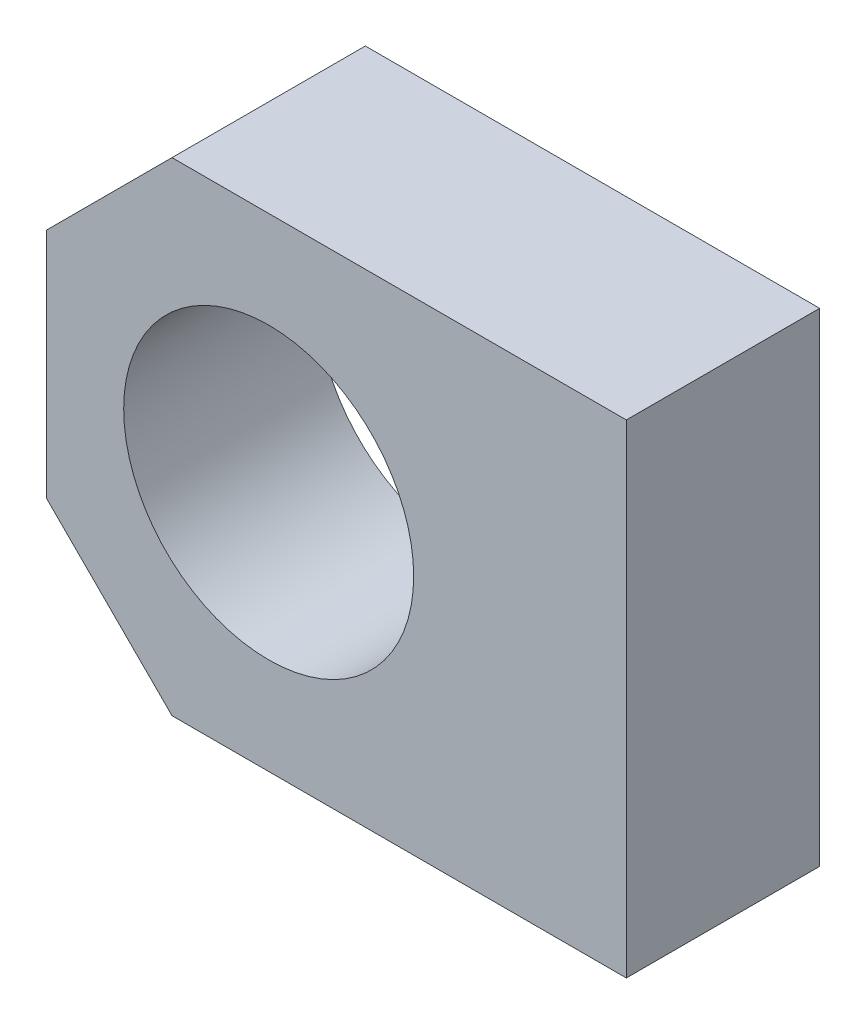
ISO-10303-21;
HEADER;
FILE_DESCRIPTION(('STEP AP214'),'2;1');
FILE_NAME('part.step','',(''),(''),'','','');
FILE_SCHEMA(('AUTOMOTIVE_DESIGN { 1 0 10303 214 1 1 1 1 }'));
ENDSEC;
DATA;
#1=APPLICATION_CONTEXT('core data for automotive mechanical design processes');
#2=APPLICATION_PROTOCOL_DEFINITION('international standard','automotive_design',2000,#1);
#3=PRODUCT_CONTEXT('',#1,'mechanical');
#4=PRODUCT('Part','Part','',(#3));
#5=PRODUCT_RELATED_PRODUCT_CATEGORY('part','',(#4));
#6=PRODUCT_DEFINITION_FORMATION('','',#4);
#7=PRODUCT_DEFINITION_CONTEXT('part definition',#1,'design');
#8=PRODUCT_DEFINITION('design','',#6,#7);
#9=PRODUCT_DEFINITION_SHAPE('','',#8);
#10=(LENGTH_UNIT() NAMED_UNIT(*) SI_UNIT(.MILLI.,.METRE.));
#11=(NAMED_UNIT(*) PLANE_ANGLE_UNIT() SI_UNIT($,.RADIAN.));
#12=(NAMED_UNIT(*) SI_UNIT($,.STERADIAN.) SOLID_ANGLE_UNIT());
#13=UNCERTAINTY_MEASURE_WITH_UNIT(LENGTH_MEASURE(1.E-05),#10,'distance_accuracy_value','');
#14=(GEOMETRIC_REPRESENTATION_CONTEXT(3) GLOBAL_UNCERTAINTY_ASSIGNED_CONTEXT((#13)) GLOBAL_UNIT_ASSIGNED_CONTEXT((#10,
#11,#12)) REPRESENTATION_CONTEXT('',''));
#15=CARTESIAN_POINT('',(0.,0.,0.));
#16=DIRECTION('',(0.,0.,1.));
#17=DIRECTION('',(1.,0.,0.));
#18=AXIS2_PLACEMENT_3D('',#15,#16,#17);
#19=CARTESIAN_POINT('',(0.,0.,20.));
#20=DIRECTION('',(0.,0.,1.));
#21=DIRECTION('',(1.,0.,0.));
#22=AXIS2_PLACEMENT_3D('',#19,#20,#21);
#23=PLANE('',#22);
#24=DIRECTION('',(0.,-1.,0.));
#25=VECTOR('',#24,1.);
#26=CARTESIAN_POINT('',(-60.,0.,20.));
#27=LINE('',#26,#25);
#28=CARTESIAN_POINT('',(-60.,37.,20.));
#29=VERTEX_POINT('',#28);
#30=CARTESIAN_POINT('',(-60.,13.,20.));
#31=VERTEX_POINT('',#30);
#32=EDGE_CURVE('E93',#29,#31,#27,.T.);
#33=ORIENTED_EDGE('',*,*,#32,.T.);
#34=DIRECTION('',(-0.707106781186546,0.707106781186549,0.));
#35=VECTOR('',#34,1.);
#36=CARTESIAN_POINT('',(-23.5000000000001,-23.5,20.));
#37=LINE('',#36,#35);
#38=CARTESIAN_POINT('',(-47.,0.,20.));
#39=VERTEX_POINT('',#38);
#40=EDGE_CURVE('E41',#31,#39,#37,.F.);
#41=ORIENTED_EDGE('',*,*,#40,.T.);
#42=DIRECTION('',(1.,0.,0.));
#43=VECTOR('',#42,1.);
#44=CARTESIAN_POINT('',(0.,0.,20.));
#45=LINE('',#44,#43);
#46=CARTESIAN_POINT('',(0.,0.,20.));
#47=VERTEX_POINT('',#46);
#48=EDGE_CURVE('E99',#39,#47,#45,.T.);
#49=ORIENTED_EDGE('',*,*,#48,.T.);
#50=DIRECTION('',(0.,1.,0.));
#51=VECTOR('',#50,1.);
#52=CARTESIAN_POINT('',(0.,0.,20.));
#53=LINE('',#52,#51);
#54=CARTESIAN_POINT('',(0.,50.,20.));
#55=VERTEX_POINT('',#54);
#56=EDGE_CURVE('E94',#47,#55,#53,.T.);
#57=ORIENTED_EDGE('',*,*,#56,.T.);
#58=DIRECTION('',(-1.,0.,0.));
#59=VECTOR('',#58,1.);
#60=CARTESIAN_POINT('',(0.,50.,20.));
#61=LINE('',#60,#59);
#62=CARTESIAN_POINT('',(-46.9999999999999,50.,20.));
#63=VERTEX_POINT('',#62);
#64=EDGE_CURVE('E85',#55,#63,#61,.T.);
#65=ORIENTED_EDGE('',*,*,#64,.T.);
#66=DIRECTION('',(0.707106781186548,0.707106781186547,0.));
#67=VECTOR('',#66,1.);
#68=CARTESIAN_POINT('',(-48.4999999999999,48.5,20.));
#69=LINE('',#68,#67);
#70=EDGE_CURVE('E124',#63,#29,#69,.F.);
#71=ORIENTED_EDGE('',*,*,#70,.T.);
#72=EDGE_LOOP('',(#33,#41,#49,#57,#65,#71));
#73=FACE_BOUND('',#72,.T.);
#74=CARTESIAN_POINT('',(-37.,25.,20.));
#75=DIRECTION('',(0.,0.,1.));
#76=DIRECTION('',(1.,0.,0.));
#77=AXIS2_PLACEMENT_3D('',#74,#75,#76);
#78=CIRCLE('',#77,15.);
#79=CARTESIAN_POINT('',(-22.,25.,20.));
#80=VERTEX_POINT('',#79);
#81=EDGE_CURVE('E144',#80,#80,#78,.T.);
#82=ORIENTED_EDGE('',*,*,#81,.F.);
#83=EDGE_LOOP('',(#82));
#84=FACE_BOUND('',#83,.T.);
#85=ADVANCED_FACE('F33',(#73,#84),#23,.T.);
#86=CARTESIAN_POINT('',(0.,0.,0.));
#87=DIRECTION('',(0.,0.,1.));
#88=DIRECTION('',(1.,0.,0.));
#89=AXIS2_PLACEMENT_3D('',#86,#87,#88);
#90=PLANE('',#89);
#91=DIRECTION('',(1.,0.,0.));
#92=VECTOR('',#91,1.);
#93=CARTESIAN_POINT('',(0.,0.,0.));
#94=LINE('',#93,#92);
#95=CARTESIAN_POINT('',(-47.,0.,0.));
#96=VERTEX_POINT('',#95);
#97=CARTESIAN_POINT('',(0.,0.,0.));
#98=VERTEX_POINT('',#97);
#99=EDGE_CURVE('E103',#96,#98,#94,.T.);
#100=ORIENTED_EDGE('',*,*,#99,.F.);
#101=DIRECTION('',(0.707106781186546,-0.707106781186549,0.));
#102=VECTOR('',#101,1.);
#103=CARTESIAN_POINT('',(-47.,0.,0.));
#104=LINE('',#103,#102);
#105=CARTESIAN_POINT('',(-60.,13.,0.));
#106=VERTEX_POINT('',#105);
#107=EDGE_CURVE('E118',#96,#106,#104,.F.);
#108=ORIENTED_EDGE('',*,*,#107,.T.);
#109=DIRECTION('',(0.,-1.,0.));
#110=VECTOR('',#109,1.);
#111=CARTESIAN_POINT('',(-60.,0.,0.));
#112=LINE('',#111,#110);
#113=CARTESIAN_POINT('',(-60.,37.,0.));
#114=VERTEX_POINT('',#113);
#115=EDGE_CURVE('E137',#114,#106,#112,.T.);
#116=ORIENTED_EDGE('',*,*,#115,.F.);
#117=DIRECTION('',(-0.707106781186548,-0.707106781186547,0.));
#118=VECTOR('',#117,1.);
#119=CARTESIAN_POINT('',(-60.,37.,0.));
#120=LINE('',#119,#118);
#121=CARTESIAN_POINT('',(-47.,50.,0.));
#122=VERTEX_POINT('',#121);
#123=EDGE_CURVE('E112',#114,#122,#120,.F.);
#124=ORIENTED_EDGE('',*,*,#123,.T.);
#125=DIRECTION('',(-1.,0.,0.));
#126=VECTOR('',#125,1.);
#127=CARTESIAN_POINT('',(0.,50.,0.));
#128=LINE('',#127,#126);
#129=CARTESIAN_POINT('',(0.,50.,0.));
#130=VERTEX_POINT('',#129);
#131=EDGE_CURVE('E140',#130,#122,#128,.T.);
#132=ORIENTED_EDGE('',*,*,#131,.F.);
#133=DIRECTION('',(0.,1.,0.));
#134=VECTOR('',#133,1.);
#135=CARTESIAN_POINT('',(0.,0.,0.));
#136=LINE('',#135,#134);
#137=EDGE_CURVE('E107',#98,#130,#136,.T.);
#138=ORIENTED_EDGE('',*,*,#137,.F.);
#139=EDGE_LOOP('',(#100,#108,#116,#124,#132,#138));
#140=FACE_BOUND('',#139,.T.);
#141=CARTESIAN_POINT('',(-37.,25.,0.));
#142=DIRECTION('',(0.,0.,1.));
#143=DIRECTION('',(1.,0.,0.));
#144=AXIS2_PLACEMENT_3D('',#141,#142,#143);
#145=CIRCLE('',#144,15.);
#146=CARTESIAN_POINT('',(-22.,25.,0.));
#147=VERTEX_POINT('',#146);
#148=EDGE_CURVE('E147',#147,#147,#145,.T.);
#149=ORIENTED_EDGE('',*,*,#148,.T.);
#150=EDGE_LOOP('',(#149));
#151=FACE_BOUND('',#150,.T.);
#152=ADVANCED_FACE('F135',(#140,#151),#90,.F.);
#153=CARTESIAN_POINT('',(0.,0.,20.));
#154=DIRECTION('',(-1.,0.,0.));
#155=DIRECTION('',(0.,0.,1.));
#156=AXIS2_PLACEMENT_3D('',#153,#154,#155);
#157=PLANE('',#156);
#158=ORIENTED_EDGE('',*,*,#137,.T.);
#159=DIRECTION('',(0.,0.,-1.));
#160=VECTOR('',#159,1.);
#161=CARTESIAN_POINT('',(0.,50.,20.));
#162=LINE('',#161,#160);
#163=EDGE_CURVE('E89',#55,#130,#162,.T.);
#164=ORIENTED_EDGE('',*,*,#163,.F.);
#165=ORIENTED_EDGE('',*,*,#56,.F.);
#166=DIRECTION('',(0.,0.,-1.));
#167=VECTOR('',#166,1.);
#168=CARTESIAN_POINT('',(0.,0.,20.));
#169=LINE('',#168,#167);
#170=EDGE_CURVE('E109',#47,#98,#169,.T.);
#171=ORIENTED_EDGE('',*,*,#170,.T.);
#172=EDGE_LOOP('',(#158,#164,#165,#171));
#173=FACE_BOUND('',#172,.T.);
#174=ADVANCED_FACE('F105',(#173),#157,.F.);
#175=CARTESIAN_POINT('',(0.,50.,20.));
#176=DIRECTION('',(0.,-1.,0.));
#177=DIRECTION('',(1.,0.,0.));
#178=AXIS2_PLACEMENT_3D('',#175,#176,#177);
#179=PLANE('',#178);
#180=ORIENTED_EDGE('',*,*,#131,.T.);
#181=DIRECTION('',(0.,0.,1.));
#182=VECTOR('',#181,1.);
#183=CARTESIAN_POINT('',(-47.,50.,20.));
#184=LINE('',#183,#182);
#185=EDGE_CURVE('E11',#122,#63,#184,.T.);
#186=ORIENTED_EDGE('',*,*,#185,.T.);
#187=ORIENTED_EDGE('',*,*,#64,.F.);
#188=ORIENTED_EDGE('',*,*,#163,.T.);
#189=EDGE_LOOP('',(#180,#186,#187,#188));
#190=FACE_BOUND('',#189,.T.);
#191=ADVANCED_FACE('F87',(#190),#179,.F.);
#192=CARTESIAN_POINT('',(-60.,0.,20.));
#193=DIRECTION('',(1.,0.,0.));
#194=DIRECTION('',(0.,0.,-1.));
#195=AXIS2_PLACEMENT_3D('',#192,#193,#194);
#196=PLANE('',#195);
#197=ORIENTED_EDGE('',*,*,#115,.T.);
#198=DIRECTION('',(0.,0.,1.));
#199=VECTOR('',#198,1.);
#200=CARTESIAN_POINT('',(-60.,13.,20.));
#201=LINE('',#200,#199);
#202=EDGE_CURVE('E54',#106,#31,#201,.T.);
#203=ORIENTED_EDGE('',*,*,#202,.T.);
#204=ORIENTED_EDGE('',*,*,#32,.F.);
#205=DIRECTION('',(0.,0.,-1.));
#206=VECTOR('',#205,1.);
#207=CARTESIAN_POINT('',(-60.,37.,20.));
#208=LINE('',#207,#206);
#209=EDGE_CURVE('E120',#29,#114,#208,.T.);
#210=ORIENTED_EDGE('',*,*,#209,.T.);
#211=EDGE_LOOP('',(#197,#203,#204,#210));
#212=FACE_BOUND('',#211,.T.);
#213=ADVANCED_FACE('F138',(#212),#196,.F.);
#214=CARTESIAN_POINT('',(0.,0.,20.));
#215=DIRECTION('',(0.,1.,0.));
#216=DIRECTION('',(-1.,0.,0.));
#217=AXIS2_PLACEMENT_3D('',#214,#215,#216);
#218=PLANE('',#217);
#219=ORIENTED_EDGE('',*,*,#48,.F.);
#220=DIRECTION('',(0.,0.,-1.));
#221=VECTOR('',#220,1.);
#222=CARTESIAN_POINT('',(-47.,0.,20.));
#223=LINE('',#222,#221);
#224=EDGE_CURVE('E108',#39,#96,#223,.T.);
#225=ORIENTED_EDGE('',*,*,#224,.T.);
#226=ORIENTED_EDGE('',*,*,#99,.T.);
#227=ORIENTED_EDGE('',*,*,#170,.F.);
#228=EDGE_LOOP('',(#219,#225,#226,#227));
#229=FACE_BOUND('',#228,.T.);
#230=ADVANCED_FACE('F129',(#229),#218,.F.);
#231=CARTESIAN_POINT('',(-37.,25.,20.));
#232=DIRECTION('',(0.,0.,-1.));
#233=DIRECTION('',(-1.,0.,0.));
#234=AXIS2_PLACEMENT_3D('',#231,#232,#233);
#235=CYLINDRICAL_SURFACE('',#234,15.);
#236=ORIENTED_EDGE('',*,*,#81,.T.);
#237=EDGE_LOOP('',(#236));
#238=FACE_BOUND('',#237,.T.);
#239=ORIENTED_EDGE('',*,*,#148,.F.);
#240=EDGE_LOOP('',(#239));
#241=FACE_BOUND('',#240,.T.);
#242=ADVANCED_FACE('F153',(#238,#241),#235,.F.);
#243=CARTESIAN_POINT('',(-47.,0.,20.));
#244=DIRECTION('',(0.707106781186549,0.707106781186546,0.));
#245=DIRECTION('',(0.,0.,-1.));
#246=AXIS2_PLACEMENT_3D('',#243,#244,#245);
#247=PLANE('',#246);
#248=ORIENTED_EDGE('',*,*,#40,.F.);
#249=ORIENTED_EDGE('',*,*,#202,.F.);
#250=ORIENTED_EDGE('',*,*,#107,.F.);
#251=ORIENTED_EDGE('',*,*,#224,.F.);
#252=EDGE_LOOP('',(#248,#249,#250,#251));
#253=FACE_BOUND('',#252,.T.);
#254=ADVANCED_FACE('F132',(#253),#247,.F.);
#255=CARTESIAN_POINT('',(-60.,37.,20.));
#256=DIRECTION('',(0.707106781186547,-0.707106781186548,0.));
#257=DIRECTION('',(0.,0.,-1.));
#258=AXIS2_PLACEMENT_3D('',#255,#256,#257);
#259=PLANE('',#258);
#260=ORIENTED_EDGE('',*,*,#70,.F.);
#261=ORIENTED_EDGE('',*,*,#185,.F.);
#262=ORIENTED_EDGE('',*,*,#123,.F.);
#263=ORIENTED_EDGE('',*,*,#209,.F.);
#264=EDGE_LOOP('',(#260,#261,#262,#263));
#265=FACE_BOUND('',#264,.T.);
#266=ADVANCED_FACE('F35',(#265),#259,.F.);
#267=CLOSED_SHELL('',(#85,#152,#174,#191,#213,#230,#242,#254,#266));
#268=MANIFOLD_SOLID_BREP('B2',#267);
#269=ADVANCED_BREP_SHAPE_REPRESENTATION('',(#18,#268),#14);
#270=SHAPE_DEFINITION_REPRESENTATION(#9,#269);
ENDSEC;
END-ISO-10303-21;
